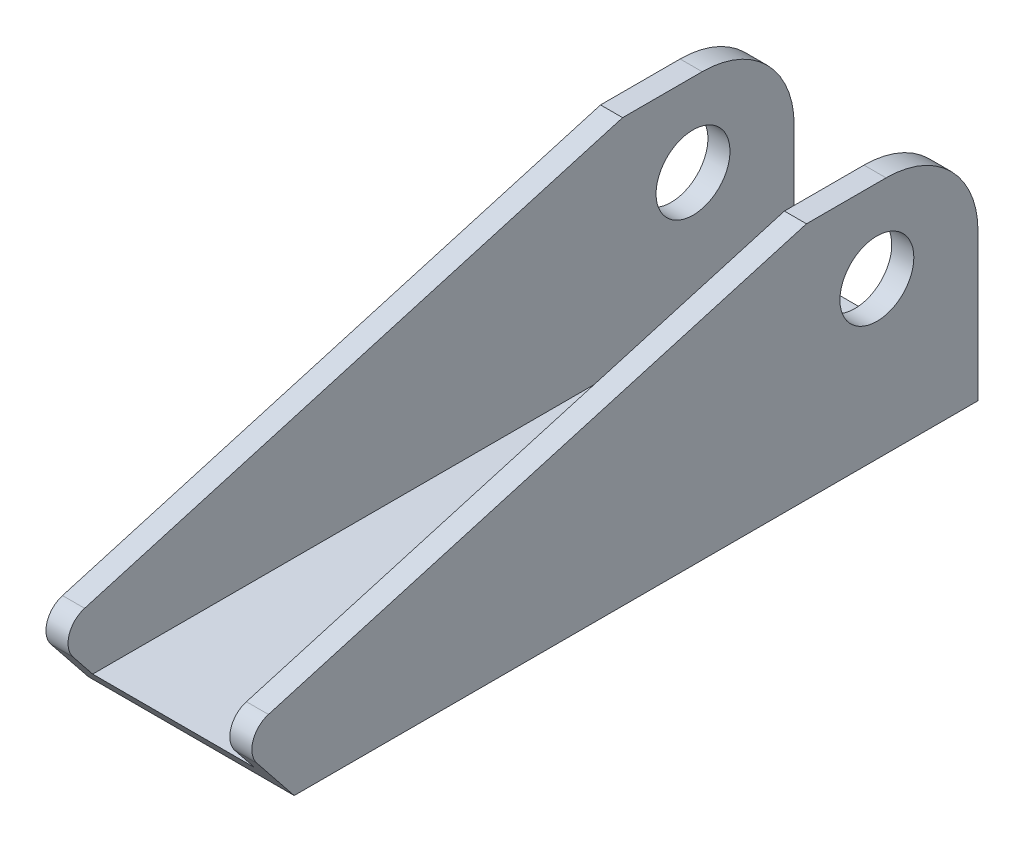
from build123d import *

# Parameters (mm, degrees)
EXTRUDE1_DEPTH             = 57.15
F_10_CLEARANCE_HOLE1_D     = 5.1054
F_10_CLEARANCE_HOLE1_DEPTH = 25.4
F_10_CLEARANCE_HOLE1_TIP   = 1.533816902
FILLET1_R                  = 6.35
CUT_EXTRUDE1_DEPTH         = 62.163917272
CUT_EXTRUDE2_DEPTH         = 62.163917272
CUT_EXTRUDE3_DEPTH         = 56.726192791
FILLET4_R                  = 1.5875


with BuildPart() as part:
    # Sketch1 → Extrude1 (new body)
    with BuildSketch(Plane.XY):
        Polygon((0, 16.51), (0, 0), (14.224, 0), (14.224, 16.51), (12.7, 16.51), (12.7, 1.524), (1.524, 1.524), (1.524, 16.51), align=None)
    extrude(amount=EXTRUDE1_DEPTH)

    # 10 Clearance Hole1
    with Locations(Plane(origin=(0, 10.795, 6.985), x_dir=(0, -1, 0), z_dir=(-1, 0, 0))):
        with Locations((0, 0)):
            Hole(F_10_CLEARANCE_HOLE1_D / 2, depth=F_10_CLEARANCE_HOLE1_DEPTH)
            with Locations((0, 0, -(F_10_CLEARANCE_HOLE1_DEPTH + F_10_CLEARANCE_HOLE1_TIP / 2))):  # 118° drill point
                Cone(0, F_10_CLEARANCE_HOLE1_D / 2, F_10_CLEARANCE_HOLE1_TIP, mode=Mode.SUBTRACT)

    # Fillet1
    fillet1_edges = [part.edges().sort_by_distance(p)[0] for p in [
        (13.462, 16.51, 0),
        (0.762, 16.51, 0),
    ]]
    fillet(fillet1_edges, radius=FILLET1_R)

    # Sketch3 → Cut-Extrude1 (cut, through all)
    with BuildSketch(Plane.ZY):
        Polygon((38.1, 16.51), (57.15, 0), (57.15, 16.51), align=None)
    extrude(amount=-CUT_EXTRUDE1_DEPTH, mode=Mode.SUBTRACT)

    # Sketch4 → Cut-Extrude2 (cut, through all)
    with BuildSketch(Plane.ZY):
        Polygon((51.288461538, 5.08), (47.231301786, 0), (57.15, 0), align=None)
    extrude(amount=-CUT_EXTRUDE2_DEPTH, mode=Mode.SUBTRACT)

    # Sketch5 → Cut-Extrude3 (cut, through all)
    with BuildSketch(Plane.ZY):
        Polygon((51.288461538, 5.08), (11.847593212, 16.51), (38.1, 16.51), align=None)
    extrude(amount=-CUT_EXTRUDE3_DEPTH, mode=Mode.SUBTRACT)

    # Fillet4
    fillet4_edges = [part.edges().sort_by_distance(p)[0] for p in [
        (0.762, 5.08, 51.288461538),
        (13.462, 5.08, 51.288461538),
    ]]
    fillet(fillet4_edges, radius=FILLET4_R)


solid = part.part
